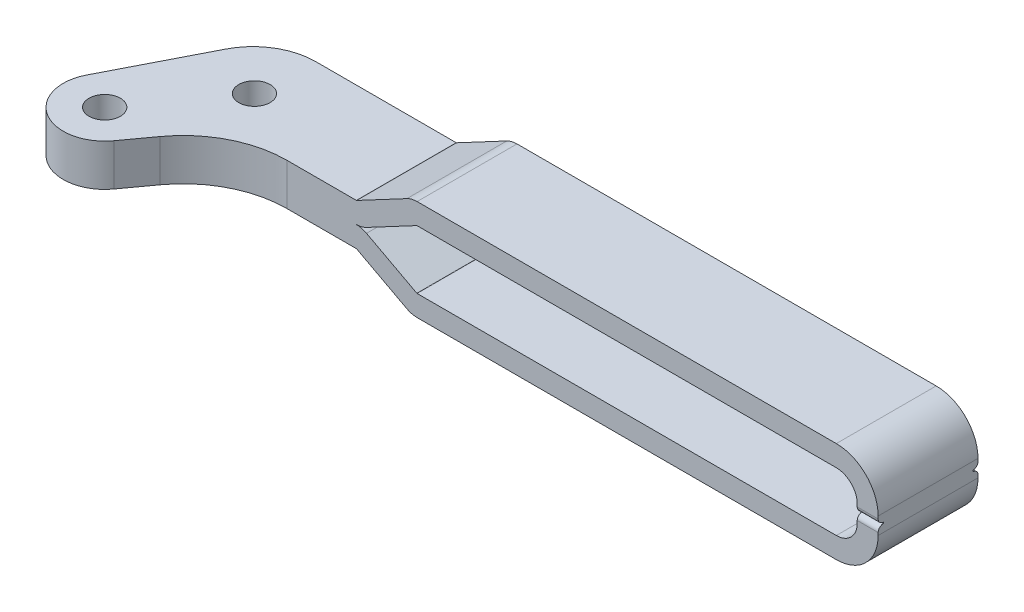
ISO-10303-21;
HEADER;
FILE_DESCRIPTION(('STEP AP214'),'2;1');
FILE_NAME('part.step','',(''),(''),'','','');
FILE_SCHEMA(('AUTOMOTIVE_DESIGN { 1 0 10303 214 1 1 1 1 }'));
ENDSEC;
DATA;
#1=APPLICATION_CONTEXT('core data for automotive mechanical design processes');
#2=APPLICATION_PROTOCOL_DEFINITION('international standard','automotive_design',2000,#1);
#3=PRODUCT_CONTEXT('',#1,'mechanical');
#4=PRODUCT('Part','Part','',(#3));
#5=PRODUCT_RELATED_PRODUCT_CATEGORY('part','',(#4));
#6=PRODUCT_DEFINITION_FORMATION('','',#4);
#7=PRODUCT_DEFINITION_CONTEXT('part definition',#1,'design');
#8=PRODUCT_DEFINITION('design','',#6,#7);
#9=PRODUCT_DEFINITION_SHAPE('','',#8);
#10=(LENGTH_UNIT() NAMED_UNIT(*) SI_UNIT(.MILLI.,.METRE.));
#11=(NAMED_UNIT(*) PLANE_ANGLE_UNIT() SI_UNIT($,.RADIAN.));
#12=(NAMED_UNIT(*) SI_UNIT($,.STERADIAN.) SOLID_ANGLE_UNIT());
#13=UNCERTAINTY_MEASURE_WITH_UNIT(LENGTH_MEASURE(1.E-05),#10,'distance_accuracy_value','');
#14=(GEOMETRIC_REPRESENTATION_CONTEXT(3) GLOBAL_UNCERTAINTY_ASSIGNED_CONTEXT((#13)) GLOBAL_UNIT_ASSIGNED_CONTEXT((#10,
#11,#12)) REPRESENTATION_CONTEXT('',''));
#15=CARTESIAN_POINT('',(0.,0.,0.));
#16=DIRECTION('',(0.,0.,1.));
#17=DIRECTION('',(1.,0.,0.));
#18=AXIS2_PLACEMENT_3D('',#15,#16,#17);
#19=CARTESIAN_POINT('',(26.2035584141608,4.,11.1981815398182));
#20=DIRECTION('',(0.,-1.,0.));
#21=DIRECTION('',(1.,0.,0.));
#22=AXIS2_PLACEMENT_3D('',#19,#20,#21);
#23=CYLINDRICAL_SURFACE('',#22,19.8437500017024);
#24=DIRECTION('',(0.,-1.,0.));
#25=VECTOR('',#24,1.);
#26=CARTESIAN_POINT('',(10.149627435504,4.00000000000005,-0.465682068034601));
#27=LINE('',#26,#25);
#28=CARTESIAN_POINT('',(10.1496274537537,-4.00000000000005,-0.465682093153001));
#29=VERTEX_POINT('',#28);
#30=CARTESIAN_POINT('',(10.1496274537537,4.00000000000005,-0.465682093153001));
#31=VERTEX_POINT('',#30);
#32=EDGE_CURVE('E201',#29,#31,#27,.F.);
#33=ORIENTED_EDGE('',*,*,#32,.F.);
#34=CARTESIAN_POINT('',(26.2035584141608,-4.00000000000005,11.1981815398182));
#35=DIRECTION('',(0.,-1.,0.));
#36=DIRECTION('',(1.,0.,0.));
#37=AXIS2_PLACEMENT_3D('',#34,#35,#36);
#38=CIRCLE('',#37,19.8437500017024);
#39=CARTESIAN_POINT('',(26.2035584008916,-4.00000000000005,-8.64556846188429));
#40=VERTEX_POINT('',#39);
#41=EDGE_CURVE('E306',#29,#40,#38,.T.);
#42=ORIENTED_EDGE('',*,*,#41,.T.);
#43=DIRECTION('',(0.,-1.,0.));
#44=VECTOR('',#43,1.);
#45=CARTESIAN_POINT('',(26.203558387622,4.,-8.64556846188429));
#46=LINE('',#45,#44);
#47=CARTESIAN_POINT('',(26.2035584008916,4.00000000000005,-8.64556846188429));
#48=VERTEX_POINT('',#47);
#49=EDGE_CURVE('E203',#48,#40,#46,.T.);
#50=ORIENTED_EDGE('',*,*,#49,.F.);
#51=CARTESIAN_POINT('',(26.2035584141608,4.00000000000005,11.1981815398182));
#52=DIRECTION('',(0.,-1.,0.));
#53=DIRECTION('',(1.,0.,0.));
#54=AXIS2_PLACEMENT_3D('',#51,#52,#53);
#55=CIRCLE('',#54,19.8437500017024);
#56=EDGE_CURVE('E205',#31,#48,#55,.T.);
#57=ORIENTED_EDGE('',*,*,#56,.F.);
#58=EDGE_LOOP('',(#33,#42,#50,#57));
#59=FACE_BOUND('',#58,.T.);
#60=ADVANCED_FACE('F14',(#59),#23,.F.);
#61=CARTESIAN_POINT('',(10.149627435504,4.00000000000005,-0.465682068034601));
#62=DIRECTION('',(0.809016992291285,0.,0.587785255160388));
#63=DIRECTION('',(-0.587785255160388,0.,0.809016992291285));
#64=AXIS2_PLACEMENT_3D('',#61,#62,#63);
#65=PLANE('',#64);
#66=DIRECTION('',(0.,-1.,0.));
#67=VECTOR('',#66,1.);
#68=CARTESIAN_POINT('',(6.4215723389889,4.,4.6655455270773));
#69=LINE('',#68,#67);
#70=CARTESIAN_POINT('',(6.4215723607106,-4.00000000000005,4.66554549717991));
#71=VERTEX_POINT('',#70);
#72=CARTESIAN_POINT('',(6.4215723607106,4.00000000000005,4.66554549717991));
#73=VERTEX_POINT('',#72);
#74=EDGE_CURVE('E198',#71,#73,#69,.F.);
#75=ORIENTED_EDGE('',*,*,#74,.F.);
#76=DIRECTION('',(-0.587785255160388,0.,0.809016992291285));
#77=VECTOR('',#76,1.);
#78=CARTESIAN_POINT('',(10.149627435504,-4.00000000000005,-0.465682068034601));
#79=LINE('',#78,#77);
#80=EDGE_CURVE('E311',#29,#71,#79,.T.);
#81=ORIENTED_EDGE('',*,*,#80,.F.);
#82=ORIENTED_EDGE('',*,*,#32,.T.);
#83=DIRECTION('',(-0.587785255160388,0.,0.809016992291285));
#84=VECTOR('',#83,1.);
#85=CARTESIAN_POINT('',(10.149627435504,4.00000000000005,-0.465682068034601));
#86=LINE('',#85,#84);
#87=EDGE_CURVE('E200',#31,#73,#86,.T.);
#88=ORIENTED_EDGE('',*,*,#87,.T.);
#89=EDGE_LOOP('',(#75,#81,#82,#88));
#90=FACE_BOUND('',#89,.T.);
#91=ADVANCED_FACE('F296',(#90),#65,.T.);
#92=CARTESIAN_POINT('',(-3.50414142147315E-13,4.,1.04083408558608E-13));
#93=DIRECTION('',(0.,-1.,0.));
#94=DIRECTION('',(1.,0.,0.));
#95=AXIS2_PLACEMENT_3D('',#92,#93,#94);
#96=CYLINDRICAL_SURFACE('',#95,7.93750000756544);
#97=DIRECTION('',(0.,-1.,0.));
#98=VECTOR('',#97,1.);
#99=CARTESIAN_POINT('',(-7.06673854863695,4.00000000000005,-3.61456949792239));
#100=LINE('',#99,#98);
#101=CARTESIAN_POINT('',(-7.0667385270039,-4.00000000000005,-3.6145695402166));
#102=VERTEX_POINT('',#101);
#103=CARTESIAN_POINT('',(-7.0667385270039,4.00000000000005,-3.6145695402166));
#104=VERTEX_POINT('',#103);
#105=EDGE_CURVE('E195',#102,#104,#100,.F.);
#106=ORIENTED_EDGE('',*,*,#105,.F.);
#107=CARTESIAN_POINT('',(-3.50414142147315E-13,-4.,1.04083408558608E-13));
#108=DIRECTION('',(0.,-1.,0.));
#109=DIRECTION('',(1.,0.,0.));
#110=AXIS2_PLACEMENT_3D('',#107,#108,#109);
#111=CIRCLE('',#110,7.93750000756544);
#112=EDGE_CURVE('E292',#71,#102,#111,.T.);
#113=ORIENTED_EDGE('',*,*,#112,.F.);
#114=ORIENTED_EDGE('',*,*,#74,.T.);
#115=CARTESIAN_POINT('',(-3.50414142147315E-13,4.,1.04083408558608E-13));
#116=DIRECTION('',(0.,-1.,0.));
#117=DIRECTION('',(1.,0.,0.));
#118=AXIS2_PLACEMENT_3D('',#115,#116,#117);
#119=CIRCLE('',#118,7.93750000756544);
#120=EDGE_CURVE('E197',#73,#104,#119,.T.);
#121=ORIENTED_EDGE('',*,*,#120,.T.);
#122=EDGE_LOOP('',(#106,#113,#114,#121));
#123=FACE_BOUND('',#122,.T.);
#124=ADVANCED_FACE('F289',(#123),#96,.T.);
#125=CARTESIAN_POINT('',(-7.06673854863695,4.00000000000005,-3.6145694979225));
#126=DIRECTION('',(-0.89029776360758,0.,-0.45537884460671));
#127=DIRECTION('',(0.45537884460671,0.,-0.89029776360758));
#128=AXIS2_PLACEMENT_3D('',#125,#126,#127);
#129=PLANE('',#128);
#130=DIRECTION('',(0.,-1.,0.));
#131=VECTOR('',#130,1.);
#132=CARTESIAN_POINT('',(1.93150828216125,4.,-21.2067767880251));
#133=LINE('',#132,#131);
#134=CARTESIAN_POINT('',(1.93150828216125,-4.,-21.2067767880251));
#135=VERTEX_POINT('',#134);
#136=CARTESIAN_POINT('',(1.93150828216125,4.,-21.2067767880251));
#137=VERTEX_POINT('',#136);
#138=EDGE_CURVE('E192',#135,#137,#133,.F.);
#139=ORIENTED_EDGE('',*,*,#138,.F.);
#140=DIRECTION('',(0.45537884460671,0.,-0.89029776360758));
#141=VECTOR('',#140,1.);
#142=CARTESIAN_POINT('',(-7.06673854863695,-4.00000000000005,-3.6145694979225));
#143=LINE('',#142,#141);
#144=EDGE_CURVE('E285',#102,#135,#143,.T.);
#145=ORIENTED_EDGE('',*,*,#144,.F.);
#146=ORIENTED_EDGE('',*,*,#105,.T.);
#147=DIRECTION('',(0.45537884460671,0.,-0.89029776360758));
#148=VECTOR('',#147,1.);
#149=CARTESIAN_POINT('',(-7.06673854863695,4.00000000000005,-3.6145694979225));
#150=LINE('',#149,#148);
#151=EDGE_CURVE('E194',#104,#137,#150,.T.);
#152=ORIENTED_EDGE('',*,*,#151,.T.);
#153=EDGE_LOOP('',(#139,#145,#146,#152));
#154=FACE_BOUND('',#153,.T.);
#155=ADVANCED_FACE('F279',(#154),#129,.T.);
#156=CARTESIAN_POINT('',(12.6150814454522,4.,-15.7422306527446));
#157=DIRECTION('',(0.,-1.,0.));
#158=DIRECTION('',(1.,0.,0.));
#159=AXIS2_PLACEMENT_3D('',#156,#157,#158);
#160=CYLINDRICAL_SURFACE('',#159,12.);
#161=DIRECTION('',(0.,-1.,0.));
#162=VECTOR('',#161,1.);
#163=CARTESIAN_POINT('',(12.6150814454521,4.,-27.7422306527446));
#164=LINE('',#163,#162);
#165=CARTESIAN_POINT('',(12.6150814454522,-4.,-27.7422306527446));
#166=VERTEX_POINT('',#165);
#167=CARTESIAN_POINT('',(12.6150814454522,4.,-27.7422306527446));
#168=VERTEX_POINT('',#167);
#169=EDGE_CURVE('E188',#166,#168,#164,.F.);
#170=ORIENTED_EDGE('',*,*,#169,.F.);
#171=CARTESIAN_POINT('',(12.6150814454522,-3.99999999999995,-15.7422306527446));
#172=DIRECTION('',(0.,-1.,0.));
#173=DIRECTION('',(1.,0.,0.));
#174=AXIS2_PLACEMENT_3D('',#171,#172,#173);
#175=CIRCLE('',#174,12.);
#176=EDGE_CURVE('E577',#135,#166,#175,.T.);
#177=ORIENTED_EDGE('',*,*,#176,.F.);
#178=ORIENTED_EDGE('',*,*,#138,.T.);
#179=CARTESIAN_POINT('',(12.6150814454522,3.99999999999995,-15.7422306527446));
#180=DIRECTION('',(0.,-1.,0.));
#181=DIRECTION('',(1.,0.,0.));
#182=AXIS2_PLACEMENT_3D('',#179,#180,#181);
#183=CIRCLE('',#182,12.);
#184=EDGE_CURVE('E191',#137,#168,#183,.T.);
#185=ORIENTED_EDGE('',*,*,#184,.T.);
#186=EDGE_LOOP('',(#170,#177,#178,#185));
#187=FACE_BOUND('',#186,.T.);
#188=ADVANCED_FACE('F273',(#187),#160,.T.);
#189=CARTESIAN_POINT('',(11.2585270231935,9.61268213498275,-27.7422306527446));
#190=DIRECTION('',(0.,0.,-1.));
#191=DIRECTION('',(1.,0.,0.));
#192=AXIS2_PLACEMENT_3D('',#189,#190,#191);
#193=PLANE('',#192);
#194=CARTESIAN_POINT('',(39.4746558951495,4.14999999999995,-27.7422306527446));
#195=DIRECTION('',(0.,0.,1.));
#196=DIRECTION('',(0.,-1.,0.));
#197=AXIS2_PLACEMENT_3D('',#194,#195,#196);
#198=CIRCLE('',#197,4.15);
#199=CARTESIAN_POINT('',(39.4746558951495,0.,-27.7422306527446));
#200=VERTEX_POINT('',#199);
#201=CARTESIAN_POINT('',(41.4229628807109,0.485767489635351,-27.7422306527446));
#202=VERTEX_POINT('',#201);
#203=EDGE_CURVE('E149',#200,#202,#198,.T.);
#204=ORIENTED_EDGE('',*,*,#203,.F.);
#205=CARTESIAN_POINT('',(39.4746558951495,-4.14999999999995,-27.7422306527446));
#206=DIRECTION('',(0.,0.,-1.));
#207=DIRECTION('',(0.,1.,0.));
#208=AXIS2_PLACEMENT_3D('',#205,#206,#207);
#209=CIRCLE('',#208,4.15);
#210=CARTESIAN_POINT('',(41.4229628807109,-0.485767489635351,-27.7422306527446));
#211=VERTEX_POINT('',#210);
#212=EDGE_CURVE('E550',#200,#211,#209,.T.);
#213=ORIENTED_EDGE('',*,*,#212,.T.);
#214=DIRECTION('',(0.882947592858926,-0.469471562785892,0.));
#215=VECTOR('',#214,1.);
#216=CARTESIAN_POINT('',(131.491168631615,-48.3758819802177,-27.7422306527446));
#217=LINE('',#216,#215);
#218=CARTESIAN_POINT('',(51.0322654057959,-5.59512427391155,-27.7422306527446));
#219=VERTEX_POINT('',#218);
#220=EDGE_CURVE('E545',#211,#219,#217,.T.);
#221=ORIENTED_EDGE('',*,*,#220,.T.);
#222=CARTESIAN_POINT('',(51.1026861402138,-5.46268213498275,-27.7422306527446));
#223=DIRECTION('',(0.,0.,-1.));
#224=DIRECTION('',(0.,1.,0.));
#225=AXIS2_PLACEMENT_3D('',#222,#223,#224);
#226=CIRCLE('',#225,0.15);
#227=CARTESIAN_POINT('',(51.1026861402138,-5.61268213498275,-27.7422306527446));
#228=VERTEX_POINT('',#227);
#229=EDGE_CURVE('E573',#228,#219,#226,.T.);
#230=ORIENTED_EDGE('',*,*,#229,.F.);
#231=DIRECTION('',(1.,0.,0.));
#232=VECTOR('',#231,1.);
#233=CARTESIAN_POINT('',(141.177342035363,-5.61268213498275,-27.7422306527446));
#234=LINE('',#233,#232);
#235=CARTESIAN_POINT('',(131.264953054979,-5.61268213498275,-27.7422306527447));
#236=VERTEX_POINT('',#235);
#237=EDGE_CURVE('E522',#228,#236,#234,.T.);
#238=ORIENTED_EDGE('',*,*,#237,.T.);
#239=CARTESIAN_POINT('',(131.264953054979,-1.61268213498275,-27.7422306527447));
#240=DIRECTION('',(0.,0.,1.));
#241=DIRECTION('',(0.,-1.,0.));
#242=AXIS2_PLACEMENT_3D('',#239,#240,#241);
#243=CIRCLE('',#242,4.);
#244=CARTESIAN_POINT('',(135.264953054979,-1.61268213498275,-27.7422306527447));
#245=VERTEX_POINT('',#244);
#246=EDGE_CURVE('E525',#245,#236,#243,.F.);
#247=ORIENTED_EDGE('',*,*,#246,.F.);
#248=DIRECTION('',(0.,1.,0.));
#249=VECTOR('',#248,1.);
#250=CARTESIAN_POINT('',(135.264953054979,-1.1250711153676,-27.7422306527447));
#251=LINE('',#250,#249);
#252=CARTESIAN_POINT('',(135.264953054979,-1.12507111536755,-27.7422306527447));
#253=VERTEX_POINT('',#252);
#254=EDGE_CURVE('E531',#245,#253,#251,.T.);
#255=ORIENTED_EDGE('',*,*,#254,.T.);
#256=DIRECTION('',(1.,0.,0.));
#257=VECTOR('',#256,1.);
#258=CARTESIAN_POINT('',(139.264953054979,-1.1250711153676,-27.7422306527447));
#259=LINE('',#258,#257);
#260=CARTESIAN_POINT('',(139.264953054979,-1.12507111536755,-27.7422306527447));
#261=VERTEX_POINT('',#260);
#262=EDGE_CURVE('E558',#261,#253,#259,.F.);
#263=ORIENTED_EDGE('',*,*,#262,.F.);
#264=DIRECTION('',(0.,-1.,0.));
#265=VECTOR('',#264,1.);
#266=CARTESIAN_POINT('',(139.264953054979,-131.043886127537,-27.7422306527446));
#267=LINE('',#266,#265);
#268=CARTESIAN_POINT('',(139.264953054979,-1.61268213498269,-27.7422306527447));
#269=VERTEX_POINT('',#268);
#270=EDGE_CURVE('E477',#269,#261,#267,.F.);
#271=ORIENTED_EDGE('',*,*,#270,.F.);
#272=CARTESIAN_POINT('',(131.264953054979,-1.61268213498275,-27.7422306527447));
#273=DIRECTION('',(0.,0.,1.));
#274=DIRECTION('',(0.,-1.,0.));
#275=AXIS2_PLACEMENT_3D('',#272,#273,#274);
#276=CIRCLE('',#275,8.);
#277=CARTESIAN_POINT('',(131.264953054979,-9.61268213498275,-27.7422306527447));
#278=VERTEX_POINT('',#277);
#279=EDGE_CURVE('E530',#278,#269,#276,.T.);
#280=ORIENTED_EDGE('',*,*,#279,.F.);
#281=DIRECTION('',(1.,0.,0.));
#282=VECTOR('',#281,1.);
#283=CARTESIAN_POINT('',(11.2585270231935,-9.61268213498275,-27.7422306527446));
#284=LINE('',#283,#282);
#285=CARTESIAN_POINT('',(51.1026861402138,-9.61268213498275,-27.7422306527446));
#286=VERTEX_POINT('',#285);
#287=EDGE_CURVE('E526',#286,#278,#284,.T.);
#288=ORIENTED_EDGE('',*,*,#287,.F.);
#289=CARTESIAN_POINT('',(51.1026861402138,-5.46268213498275,-27.7422306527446));
#290=DIRECTION('',(0.,0.,-1.));
#291=DIRECTION('',(0.,1.,0.));
#292=AXIS2_PLACEMENT_3D('',#289,#290,#291);
#293=CIRCLE('',#292,4.15);
#294=CARTESIAN_POINT('',(49.1543791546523,-9.1269146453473,-27.7422306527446));
#295=VERTEX_POINT('',#294);
#296=EDGE_CURVE('E534',#295,#286,#293,.F.);
#297=ORIENTED_EDGE('',*,*,#296,.F.);
#298=DIRECTION('',(0.882947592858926,-0.469471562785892,0.));
#299=VECTOR('',#298,1.);
#300=CARTESIAN_POINT('',(39.5450766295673,-4.0175578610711,-27.7422306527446));
#301=LINE('',#300,#299);
#302=CARTESIAN_POINT('',(39.5450766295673,-4.0175578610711,-27.7422306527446));
#303=VERTEX_POINT('',#302);
#304=EDGE_CURVE('E540',#303,#295,#301,.T.);
#305=ORIENTED_EDGE('',*,*,#304,.F.);
#306=CARTESIAN_POINT('',(39.4746558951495,-4.14999999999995,-27.7422306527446));
#307=DIRECTION('',(0.,0.,-1.));
#308=DIRECTION('',(0.,1.,0.));
#309=AXIS2_PLACEMENT_3D('',#306,#307,#308);
#310=CIRCLE('',#309,0.149999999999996);
#311=CARTESIAN_POINT('',(39.4746558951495,-4.,-27.7422306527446));
#312=VERTEX_POINT('',#311);
#313=EDGE_CURVE('E315',#312,#303,#310,.T.);
#314=ORIENTED_EDGE('',*,*,#313,.F.);
#315=DIRECTION('',(1.,0.,0.));
#316=VECTOR('',#315,1.);
#317=CARTESIAN_POINT('',(12.6150814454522,-4.,-27.7422306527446));
#318=LINE('',#317,#316);
#319=EDGE_CURVE('E269',#166,#312,#318,.T.);
#320=ORIENTED_EDGE('',*,*,#319,.F.);
#321=ORIENTED_EDGE('',*,*,#169,.T.);
#322=DIRECTION('',(1.,0.,0.));
#323=VECTOR('',#322,1.);
#324=CARTESIAN_POINT('',(12.6150814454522,4.,-27.7422306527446));
#325=LINE('',#324,#323);
#326=CARTESIAN_POINT('',(39.4746558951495,4.,-27.7422306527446));
#327=VERTEX_POINT('',#326);
#328=EDGE_CURVE('E190',#168,#327,#325,.T.);
#329=ORIENTED_EDGE('',*,*,#328,.T.);
#330=CARTESIAN_POINT('',(39.4746558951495,4.14999999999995,-27.7422306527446));
#331=DIRECTION('',(0.,0.,1.));
#332=DIRECTION('',(0.,-1.,0.));
#333=AXIS2_PLACEMENT_3D('',#330,#331,#332);
#334=CIRCLE('',#333,0.149999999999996);
#335=CARTESIAN_POINT('',(39.5450766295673,4.0175578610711,-27.7422306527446));
#336=VERTEX_POINT('',#335);
#337=EDGE_CURVE('E208',#327,#336,#334,.T.);
#338=ORIENTED_EDGE('',*,*,#337,.T.);
#339=DIRECTION('',(0.882947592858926,0.469471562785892,0.));
#340=VECTOR('',#339,1.);
#341=CARTESIAN_POINT('',(39.5450766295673,4.0175578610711,-27.7422306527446));
#342=LINE('',#341,#340);
#343=CARTESIAN_POINT('',(49.1543791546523,9.1269146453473,-27.7422306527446));
#344=VERTEX_POINT('',#343);
#345=EDGE_CURVE('E139',#336,#344,#342,.T.);
#346=ORIENTED_EDGE('',*,*,#345,.T.);
#347=CARTESIAN_POINT('',(51.1026861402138,5.46268213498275,-27.7422306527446));
#348=DIRECTION('',(0.,0.,1.));
#349=DIRECTION('',(0.,-1.,0.));
#350=AXIS2_PLACEMENT_3D('',#347,#348,#349);
#351=CIRCLE('',#350,4.15);
#352=CARTESIAN_POINT('',(51.1026861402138,9.61268213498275,-27.7422306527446));
#353=VERTEX_POINT('',#352);
#354=EDGE_CURVE('E235',#344,#353,#351,.F.);
#355=ORIENTED_EDGE('',*,*,#354,.T.);
#356=DIRECTION('',(1.,0.,0.));
#357=VECTOR('',#356,1.);
#358=CARTESIAN_POINT('',(11.2585270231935,9.61268213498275,-27.7422306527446));
#359=LINE('',#358,#357);
#360=CARTESIAN_POINT('',(131.264953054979,9.61268213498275,-27.7422306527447));
#361=VERTEX_POINT('',#360);
#362=EDGE_CURVE('E186',#353,#361,#359,.T.);
#363=ORIENTED_EDGE('',*,*,#362,.T.);
#364=CARTESIAN_POINT('',(131.264953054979,1.61268213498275,-27.7422306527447));
#365=DIRECTION('',(0.,0.,-1.));
#366=DIRECTION('',(0.,1.,0.));
#367=AXIS2_PLACEMENT_3D('',#364,#365,#366);
#368=CIRCLE('',#367,8.);
#369=CARTESIAN_POINT('',(139.264953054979,1.61268213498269,-27.7422306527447));
#370=VERTEX_POINT('',#369);
#371=EDGE_CURVE('E231',#361,#370,#368,.T.);
#372=ORIENTED_EDGE('',*,*,#371,.T.);
#373=DIRECTION('',(0.,1.,0.));
#374=VECTOR('',#373,1.);
#375=CARTESIAN_POINT('',(139.264953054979,131.043886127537,-27.7422306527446));
#376=LINE('',#375,#374);
#377=CARTESIAN_POINT('',(139.264953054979,1.12507111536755,-27.7422306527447));
#378=VERTEX_POINT('',#377);
#379=EDGE_CURVE('E167',#370,#378,#376,.F.);
#380=ORIENTED_EDGE('',*,*,#379,.T.);
#381=DIRECTION('',(1.,0.,0.));
#382=VECTOR('',#381,1.);
#383=CARTESIAN_POINT('',(139.264953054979,1.1250711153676,-27.7422306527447));
#384=LINE('',#383,#382);
#385=CARTESIAN_POINT('',(135.264953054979,1.12507111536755,-27.7422306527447));
#386=VERTEX_POINT('',#385);
#387=EDGE_CURVE('E170',#378,#386,#384,.F.);
#388=ORIENTED_EDGE('',*,*,#387,.T.);
#389=DIRECTION('',(0.,-1.,0.));
#390=VECTOR('',#389,1.);
#391=CARTESIAN_POINT('',(135.264953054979,1.1250711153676,-27.7422306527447));
#392=LINE('',#391,#390);
#393=CARTESIAN_POINT('',(135.264953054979,1.61268213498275,-27.7422306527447));
#394=VERTEX_POINT('',#393);
#395=EDGE_CURVE('E238',#394,#386,#392,.T.);
#396=ORIENTED_EDGE('',*,*,#395,.F.);
#397=CARTESIAN_POINT('',(131.264953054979,1.61268213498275,-27.7422306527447));
#398=DIRECTION('',(0.,0.,-1.));
#399=DIRECTION('',(0.,1.,0.));
#400=AXIS2_PLACEMENT_3D('',#397,#398,#399);
#401=CIRCLE('',#400,4.);
#402=CARTESIAN_POINT('',(131.264953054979,5.61268213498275,-27.7422306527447));
#403=VERTEX_POINT('',#402);
#404=EDGE_CURVE('E220',#394,#403,#401,.F.);
#405=ORIENTED_EDGE('',*,*,#404,.T.);
#406=DIRECTION('',(1.,0.,0.));
#407=VECTOR('',#406,1.);
#408=CARTESIAN_POINT('',(141.177342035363,5.61268213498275,-27.7422306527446));
#409=LINE('',#408,#407);
#410=CARTESIAN_POINT('',(51.1026861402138,5.61268213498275,-27.7422306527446));
#411=VERTEX_POINT('',#410);
#412=EDGE_CURVE('E337',#411,#403,#409,.T.);
#413=ORIENTED_EDGE('',*,*,#412,.F.);
#414=CARTESIAN_POINT('',(51.1026861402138,5.46268213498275,-27.7422306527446));
#415=DIRECTION('',(0.,0.,1.));
#416=DIRECTION('',(0.,-1.,0.));
#417=AXIS2_PLACEMENT_3D('',#414,#415,#416);
#418=CIRCLE('',#417,0.15);
#419=CARTESIAN_POINT('',(51.0322654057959,5.59512427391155,-27.7422306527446));
#420=VERTEX_POINT('',#419);
#421=EDGE_CURVE('E239',#411,#420,#418,.T.);
#422=ORIENTED_EDGE('',*,*,#421,.T.);
#423=DIRECTION('',(0.882947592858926,0.469471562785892,0.));
#424=VECTOR('',#423,1.);
#425=CARTESIAN_POINT('',(131.491168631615,48.3758819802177,-27.7422306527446));
#426=LINE('',#425,#424);
#427=EDGE_CURVE('E180',#202,#420,#426,.T.);
#428=ORIENTED_EDGE('',*,*,#427,.F.);
#429=EDGE_LOOP('',(#204,#213,#221,#230,#238,#247,#255,#263,#271,#280,#288,#297,#305,#314,#320,
#321,#329,#338,#346,#355,#363,#372,#380,#388,#396,#405,#413,#422,#428));
#430=FACE_BOUND('',#429,.T.);
#431=ADVANCED_FACE('F263',(#430),#193,.T.);
#432=CARTESIAN_POINT('',(24.8470039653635,9.61268213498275,-8.64556846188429));
#433=DIRECTION('',(0.,0.,1.));
#434=DIRECTION('',(0.,-1.,0.));
#435=AXIS2_PLACEMENT_3D('',#432,#433,#434);
#436=PLANE('',#435);
#437=ORIENTED_EDGE('',*,*,#49,.T.);
#438=DIRECTION('',(1.,0.,0.));
#439=VECTOR('',#438,1.);
#440=CARTESIAN_POINT('',(26.203558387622,-4.,-8.64556846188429));
#441=LINE('',#440,#439);
#442=CARTESIAN_POINT('',(39.4746558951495,-4.,-8.64556846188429));
#443=VERTEX_POINT('',#442);
#444=EDGE_CURVE('E312',#443,#40,#441,.F.);
#445=ORIENTED_EDGE('',*,*,#444,.F.);
#446=CARTESIAN_POINT('',(39.4746558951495,-4.14999999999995,-8.64556846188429));
#447=DIRECTION('',(0.,0.,-1.));
#448=DIRECTION('',(0.,1.,0.));
#449=AXIS2_PLACEMENT_3D('',#446,#447,#448);
#450=CIRCLE('',#449,0.149999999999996);
#451=CARTESIAN_POINT('',(39.5450766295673,-4.0175578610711,-8.64556846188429));
#452=VERTEX_POINT('',#451);
#453=EDGE_CURVE('E325',#452,#443,#450,.F.);
#454=ORIENTED_EDGE('',*,*,#453,.F.);
#455=DIRECTION('',(-0.882947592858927,0.469471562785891,0.));
#456=VECTOR('',#455,1.);
#457=CARTESIAN_POINT('',(49.1543791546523,-9.12691464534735,-8.64556846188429));
#458=LINE('',#457,#456);
#459=CARTESIAN_POINT('',(49.1543791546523,-9.1269146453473,-8.64556846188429));
#460=VERTEX_POINT('',#459);
#461=EDGE_CURVE('E547',#460,#452,#458,.T.);
#462=ORIENTED_EDGE('',*,*,#461,.F.);
#463=CARTESIAN_POINT('',(51.1026861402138,-5.46268213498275,-8.64556846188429));
#464=DIRECTION('',(0.,0.,-1.));
#465=DIRECTION('',(0.,1.,0.));
#466=AXIS2_PLACEMENT_3D('',#463,#464,#465);
#467=CIRCLE('',#466,4.15);
#468=CARTESIAN_POINT('',(51.1026861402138,-9.61268213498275,-8.64556846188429));
#469=VERTEX_POINT('',#468);
#470=EDGE_CURVE('E566',#469,#460,#467,.T.);
#471=ORIENTED_EDGE('',*,*,#470,.F.);
#472=DIRECTION('',(1.,0.,0.));
#473=VECTOR('',#472,1.);
#474=CARTESIAN_POINT('',(24.8470039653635,-9.61268213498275,-8.64556846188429));
#475=LINE('',#474,#473);
#476=CARTESIAN_POINT('',(131.264953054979,-9.61268213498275,-8.64556846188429));
#477=VERTEX_POINT('',#476);
#478=EDGE_CURVE('E505',#477,#469,#475,.F.);
#479=ORIENTED_EDGE('',*,*,#478,.F.);
#480=CARTESIAN_POINT('',(131.264953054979,-1.61268213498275,-8.64556846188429));
#481=DIRECTION('',(0.,0.,1.));
#482=DIRECTION('',(0.,-1.,0.));
#483=AXIS2_PLACEMENT_3D('',#480,#481,#482);
#484=CIRCLE('',#483,8.);
#485=CARTESIAN_POINT('',(139.264953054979,-1.61268213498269,-8.64556846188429));
#486=VERTEX_POINT('',#485);
#487=EDGE_CURVE('E518',#486,#477,#484,.F.);
#488=ORIENTED_EDGE('',*,*,#487,.F.);
#489=DIRECTION('',(0.,1.,0.));
#490=VECTOR('',#489,1.);
#491=CARTESIAN_POINT('',(139.264953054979,-117.455409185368,-8.64556846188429));
#492=LINE('',#491,#490);
#493=CARTESIAN_POINT('',(139.264953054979,-1.12507111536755,-8.64556846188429));
#494=VERTEX_POINT('',#493);
#495=EDGE_CURVE('E552',#494,#486,#492,.F.);
#496=ORIENTED_EDGE('',*,*,#495,.F.);
#497=DIRECTION('',(1.,0.,0.));
#498=VECTOR('',#497,1.);
#499=CARTESIAN_POINT('',(139.264953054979,-1.1250711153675,-8.64556846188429));
#500=LINE('',#499,#498);
#501=CARTESIAN_POINT('',(135.264953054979,-1.12507111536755,-8.64556846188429));
#502=VERTEX_POINT('',#501);
#503=EDGE_CURVE('E555',#502,#494,#500,.T.);
#504=ORIENTED_EDGE('',*,*,#503,.F.);
#505=DIRECTION('',(0.,1.,0.));
#506=VECTOR('',#505,1.);
#507=CARTESIAN_POINT('',(135.264953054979,-1.1250711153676,-8.64556846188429));
#508=LINE('',#507,#506);
#509=CARTESIAN_POINT('',(135.264953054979,-1.61268213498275,-8.64556846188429));
#510=VERTEX_POINT('',#509);
#511=EDGE_CURVE('E484',#502,#510,#508,.F.);
#512=ORIENTED_EDGE('',*,*,#511,.T.);
#513=CARTESIAN_POINT('',(131.264953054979,-1.61268213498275,-8.64556846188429));
#514=DIRECTION('',(0.,0.,1.));
#515=DIRECTION('',(0.,-1.,0.));
#516=AXIS2_PLACEMENT_3D('',#513,#514,#515);
#517=CIRCLE('',#516,4.);
#518=CARTESIAN_POINT('',(131.264953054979,-5.61268213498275,-8.64556846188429));
#519=VERTEX_POINT('',#518);
#520=EDGE_CURVE('E509',#519,#510,#517,.T.);
#521=ORIENTED_EDGE('',*,*,#520,.F.);
#522=DIRECTION('',(1.,0.,0.));
#523=VECTOR('',#522,1.);
#524=CARTESIAN_POINT('',(141.177342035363,-5.61268213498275,-8.64556846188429));
#525=LINE('',#524,#523);
#526=CARTESIAN_POINT('',(51.1026861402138,-5.61268213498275,-8.64556846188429));
#527=VERTEX_POINT('',#526);
#528=EDGE_CURVE('E511',#519,#527,#525,.F.);
#529=ORIENTED_EDGE('',*,*,#528,.T.);
#530=CARTESIAN_POINT('',(51.1026861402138,-5.46268213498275,-8.64556846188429));
#531=DIRECTION('',(0.,0.,-1.));
#532=DIRECTION('',(0.,1.,0.));
#533=AXIS2_PLACEMENT_3D('',#530,#531,#532);
#534=CIRCLE('',#533,0.15);
#535=CARTESIAN_POINT('',(51.032265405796,-5.59512427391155,-8.64556846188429));
#536=VERTEX_POINT('',#535);
#537=EDGE_CURVE('E520',#536,#527,#534,.F.);
#538=ORIENTED_EDGE('',*,*,#537,.F.);
#539=DIRECTION('',(0.882947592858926,-0.469471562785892,0.));
#540=VECTOR('',#539,1.);
#541=CARTESIAN_POINT('',(131.491168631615,-48.3758819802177,-8.64556846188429));
#542=LINE('',#541,#540);
#543=CARTESIAN_POINT('',(41.4229628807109,-0.485767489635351,-8.64556846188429));
#544=VERTEX_POINT('',#543);
#545=EDGE_CURVE('E542',#536,#544,#542,.F.);
#546=ORIENTED_EDGE('',*,*,#545,.T.);
#547=CARTESIAN_POINT('',(39.4746558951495,-4.14999999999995,-8.64556846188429));
#548=DIRECTION('',(0.,0.,-1.));
#549=DIRECTION('',(0.,1.,0.));
#550=AXIS2_PLACEMENT_3D('',#547,#548,#549);
#551=CIRCLE('',#550,4.15);
#552=CARTESIAN_POINT('',(39.4746558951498,0.,-8.64556846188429));
#553=VERTEX_POINT('',#552);
#554=EDGE_CURVE('E574',#544,#553,#551,.F.);
#555=ORIENTED_EDGE('',*,*,#554,.T.);
#556=CARTESIAN_POINT('',(39.4746558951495,4.14999999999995,-8.64556846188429));
#557=DIRECTION('',(0.,0.,1.));
#558=DIRECTION('',(0.,-1.,0.));
#559=AXIS2_PLACEMENT_3D('',#556,#557,#558);
#560=CIRCLE('',#559,4.15);
#561=CARTESIAN_POINT('',(41.4229628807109,0.485767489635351,-8.64556846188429));
#562=VERTEX_POINT('',#561);
#563=EDGE_CURVE('E152',#562,#553,#560,.F.);
#564=ORIENTED_EDGE('',*,*,#563,.F.);
#565=DIRECTION('',(0.882947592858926,0.469471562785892,0.));
#566=VECTOR('',#565,1.);
#567=CARTESIAN_POINT('',(131.491168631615,48.3758819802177,-8.64556846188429));
#568=LINE('',#567,#566);
#569=CARTESIAN_POINT('',(51.032265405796,5.59512427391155,-8.64556846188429));
#570=VERTEX_POINT('',#569);
#571=EDGE_CURVE('E182',#570,#562,#568,.F.);
#572=ORIENTED_EDGE('',*,*,#571,.F.);
#573=CARTESIAN_POINT('',(51.1026861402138,5.46268213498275,-8.64556846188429));
#574=DIRECTION('',(0.,0.,1.));
#575=DIRECTION('',(0.,-1.,0.));
#576=AXIS2_PLACEMENT_3D('',#573,#574,#575);
#577=CIRCLE('',#576,0.15);
#578=CARTESIAN_POINT('',(51.1026861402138,5.61268213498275,-8.64556846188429));
#579=VERTEX_POINT('',#578);
#580=EDGE_CURVE('E33',#570,#579,#577,.F.);
#581=ORIENTED_EDGE('',*,*,#580,.T.);
#582=DIRECTION('',(1.,0.,0.));
#583=VECTOR('',#582,1.);
#584=CARTESIAN_POINT('',(141.177342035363,5.61268213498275,-8.64556846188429));
#585=LINE('',#584,#583);
#586=CARTESIAN_POINT('',(131.264953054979,5.61268213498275,-8.64556846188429));
#587=VERTEX_POINT('',#586);
#588=EDGE_CURVE('E24',#587,#579,#585,.F.);
#589=ORIENTED_EDGE('',*,*,#588,.F.);
#590=CARTESIAN_POINT('',(131.264953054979,1.61268213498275,-8.64556846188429));
#591=DIRECTION('',(0.,0.,-1.));
#592=DIRECTION('',(0.,1.,0.));
#593=AXIS2_PLACEMENT_3D('',#590,#591,#592);
#594=CIRCLE('',#593,4.);
#595=CARTESIAN_POINT('',(135.264953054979,1.61268213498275,-8.64556846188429));
#596=VERTEX_POINT('',#595);
#597=EDGE_CURVE('E216',#587,#596,#594,.T.);
#598=ORIENTED_EDGE('',*,*,#597,.T.);
#599=DIRECTION('',(0.,-1.,0.));
#600=VECTOR('',#599,1.);
#601=CARTESIAN_POINT('',(135.264953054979,1.1250711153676,-8.64556846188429));
#602=LINE('',#601,#600);
#603=CARTESIAN_POINT('',(135.264953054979,1.12507111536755,-8.64556846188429));
#604=VERTEX_POINT('',#603);
#605=EDGE_CURVE('E234',#604,#596,#602,.F.);
#606=ORIENTED_EDGE('',*,*,#605,.F.);
#607=DIRECTION('',(1.,0.,0.));
#608=VECTOR('',#607,1.);
#609=CARTESIAN_POINT('',(139.264953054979,1.1250711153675,-8.64556846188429));
#610=LINE('',#609,#608);
#611=CARTESIAN_POINT('',(139.264953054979,1.12507111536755,-8.64556846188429));
#612=VERTEX_POINT('',#611);
#613=EDGE_CURVE('E166',#604,#612,#610,.T.);
#614=ORIENTED_EDGE('',*,*,#613,.T.);
#615=DIRECTION('',(0.,-1.,0.));
#616=VECTOR('',#615,1.);
#617=CARTESIAN_POINT('',(139.264953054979,117.455409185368,-8.64556846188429));
#618=LINE('',#617,#616);
#619=CARTESIAN_POINT('',(139.264953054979,1.61268213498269,-8.64556846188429));
#620=VERTEX_POINT('',#619);
#621=EDGE_CURVE('E163',#612,#620,#618,.F.);
#622=ORIENTED_EDGE('',*,*,#621,.T.);
#623=CARTESIAN_POINT('',(131.264953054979,1.61268213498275,-8.64556846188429));
#624=DIRECTION('',(0.,0.,-1.));
#625=DIRECTION('',(0.,1.,0.));
#626=AXIS2_PLACEMENT_3D('',#623,#624,#625);
#627=CIRCLE('',#626,8.);
#628=CARTESIAN_POINT('',(131.264953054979,9.61268213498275,-8.64556846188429));
#629=VERTEX_POINT('',#628);
#630=EDGE_CURVE('E227',#620,#629,#627,.F.);
#631=ORIENTED_EDGE('',*,*,#630,.T.);
#632=DIRECTION('',(1.,0.,0.));
#633=VECTOR('',#632,1.);
#634=CARTESIAN_POINT('',(24.8470039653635,9.61268213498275,-8.64556846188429));
#635=LINE('',#634,#633);
#636=CARTESIAN_POINT('',(51.1026861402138,9.61268213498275,-8.64556846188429));
#637=VERTEX_POINT('',#636);
#638=EDGE_CURVE('E219',#629,#637,#635,.F.);
#639=ORIENTED_EDGE('',*,*,#638,.T.);
#640=CARTESIAN_POINT('',(51.1026861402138,5.46268213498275,-8.64556846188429));
#641=DIRECTION('',(0.,0.,1.));
#642=DIRECTION('',(0.,-1.,0.));
#643=AXIS2_PLACEMENT_3D('',#640,#641,#642);
#644=CIRCLE('',#643,4.15);
#645=CARTESIAN_POINT('',(49.1543791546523,9.1269146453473,-8.64556846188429));
#646=VERTEX_POINT('',#645);
#647=EDGE_CURVE('E148',#637,#646,#644,.T.);
#648=ORIENTED_EDGE('',*,*,#647,.T.);
#649=DIRECTION('',(-0.882947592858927,-0.469471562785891,0.));
#650=VECTOR('',#649,1.);
#651=CARTESIAN_POINT('',(49.1543791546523,9.12691464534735,-8.64556846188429));
#652=LINE('',#651,#650);
#653=CARTESIAN_POINT('',(39.5450766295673,4.0175578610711,-8.64556846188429));
#654=VERTEX_POINT('',#653);
#655=EDGE_CURVE('E136',#646,#654,#652,.T.);
#656=ORIENTED_EDGE('',*,*,#655,.T.);
#657=CARTESIAN_POINT('',(39.4746558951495,4.14999999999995,-8.64556846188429));
#658=DIRECTION('',(0.,0.,1.));
#659=DIRECTION('',(0.,-1.,0.));
#660=AXIS2_PLACEMENT_3D('',#657,#658,#659);
#661=CIRCLE('',#660,0.149999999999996);
#662=CARTESIAN_POINT('',(39.4746558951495,4.,-8.64556846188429));
#663=VERTEX_POINT('',#662);
#664=EDGE_CURVE('E18',#654,#663,#661,.F.);
#665=ORIENTED_EDGE('',*,*,#664,.T.);
#666=DIRECTION('',(1.,0.,0.));
#667=VECTOR('',#666,1.);
#668=CARTESIAN_POINT('',(26.203558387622,4.,-8.64556846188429));
#669=LINE('',#668,#667);
#670=EDGE_CURVE('E206',#663,#48,#669,.F.);
#671=ORIENTED_EDGE('',*,*,#670,.T.);
#672=EDGE_LOOP('',(#437,#445,#454,#462,#471,#479,#488,#496,#504,#512,#521,#529,#538,#546,#555,
#564,#572,#581,#589,#598,#606,#614,#622,#631,#639,#648,#656,#665,#671));
#673=FACE_BOUND('',#672,.T.);
#674=ADVANCED_FACE('F145',(#673),#436,.T.);
#675=CARTESIAN_POINT('',(142.533896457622,4.,-9.6455684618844));
#676=DIRECTION('',(0.,-1.,0.));
#677=DIRECTION('',(1.,0.,0.));
#678=AXIS2_PLACEMENT_3D('',#675,#676,#677);
#679=PLANE('',#678);
#680=DIRECTION('',(0.,0.,1.));
#681=VECTOR('',#680,1.);
#682=CARTESIAN_POINT('',(39.4746558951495,4.,-9.6455684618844));
#683=LINE('',#682,#681);
#684=EDGE_CURVE('E128',#663,#327,#683,.F.);
#685=ORIENTED_EDGE('',*,*,#684,.T.);
#686=ORIENTED_EDGE('',*,*,#328,.F.);
#687=ORIENTED_EDGE('',*,*,#184,.F.);
#688=ORIENTED_EDGE('',*,*,#151,.F.);
#689=ORIENTED_EDGE('',*,*,#120,.F.);
#690=ORIENTED_EDGE('',*,*,#87,.F.);
#691=ORIENTED_EDGE('',*,*,#56,.T.);
#692=ORIENTED_EDGE('',*,*,#670,.F.);
#693=EDGE_LOOP('',(#685,#686,#687,#688,#689,#690,#691,#692));
#694=FACE_BOUND('',#693,.T.);
#695=CARTESIAN_POINT('',(0.,4.,0.));
#696=DIRECTION('',(0.,1.,0.));
#697=DIRECTION('',(0.,0.,1.));
#698=AXIS2_PLACEMENT_3D('',#695,#696,#697);
#699=CIRCLE('',#698,3.);
#700=CARTESIAN_POINT('',(0.,4.,3.));
#701=VERTEX_POINT('',#700);
#702=EDGE_CURVE('E498',#701,#701,#699,.T.);
#703=ORIENTED_EDGE('',*,*,#702,.F.);
#704=EDGE_LOOP('',(#703));
#705=FACE_BOUND('',#704,.T.);
#706=CARTESIAN_POINT('',(12.0483044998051,4.,-16.5830684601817));
#707=DIRECTION('',(0.,1.,0.));
#708=DIRECTION('',(0.,0.,1.));
#709=AXIS2_PLACEMENT_3D('',#706,#707,#708);
#710=CIRCLE('',#709,3.);
#711=CARTESIAN_POINT('',(12.0483044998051,4.,-13.5830684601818));
#712=VERTEX_POINT('',#711);
#713=EDGE_CURVE('E915',#712,#712,#710,.T.);
#714=ORIENTED_EDGE('',*,*,#713,.F.);
#715=EDGE_LOOP('',(#714));
#716=FACE_BOUND('',#715,.T.);
#717=ADVANCED_FACE('F16',(#694,#705,#716),#679,.F.);
#718=CARTESIAN_POINT('',(39.4746558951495,4.14999999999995,-37.733256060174));
#719=DIRECTION('',(0.,0.,1.));
#720=DIRECTION('',(0.,-1.,0.));
#721=AXIS2_PLACEMENT_3D('',#718,#719,#720);
#722=CYLINDRICAL_SURFACE('',#721,0.149999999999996);
#723=ORIENTED_EDGE('',*,*,#684,.F.);
#724=ORIENTED_EDGE('',*,*,#664,.F.);
#725=DIRECTION('',(0.,0.,1.));
#726=VECTOR('',#725,1.);
#727=CARTESIAN_POINT('',(39.5450766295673,4.0175578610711,-9.6455684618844));
#728=LINE('',#727,#726);
#729=EDGE_CURVE('E126',#654,#336,#728,.F.);
#730=ORIENTED_EDGE('',*,*,#729,.T.);
#731=ORIENTED_EDGE('',*,*,#337,.F.);
#732=EDGE_LOOP('',(#723,#724,#730,#731));
#733=FACE_BOUND('',#732,.T.);
#734=ADVANCED_FACE('F124',(#733),#722,.F.);
#735=CARTESIAN_POINT('',(139.264953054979,1.1250711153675,-26.7422306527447));
#736=DIRECTION('',(-1.,0.,0.));
#737=DIRECTION('',(0.,-1.,0.));
#738=AXIS2_PLACEMENT_3D('',#735,#736,#737);
#739=CYLINDRICAL_SURFACE('',#738,1.);
#740=CARTESIAN_POINT('',(139.264953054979,1.1250711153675,-26.7422306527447));
#741=DIRECTION('',(-1.,0.,0.));
#742=DIRECTION('',(0.,-1.,0.));
#743=AXIS2_PLACEMENT_3D('',#740,#741,#742);
#744=CIRCLE('',#743,1.);
#745=CARTESIAN_POINT('',(139.264953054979,0.125071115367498,-26.7422306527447));
#746=VERTEX_POINT('',#745);
#747=EDGE_CURVE('E245',#378,#746,#744,.T.);
#748=ORIENTED_EDGE('',*,*,#747,.T.);
#749=DIRECTION('',(1.,0.,0.));
#750=VECTOR('',#749,1.);
#751=CARTESIAN_POINT('',(139.264953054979,0.125071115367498,-26.7422306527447));
#752=LINE('',#751,#750);
#753=CARTESIAN_POINT('',(135.264953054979,0.125071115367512,-26.7422306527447));
#754=VERTEX_POINT('',#753);
#755=EDGE_CURVE('E140',#754,#746,#752,.T.);
#756=ORIENTED_EDGE('',*,*,#755,.F.);
#757=CARTESIAN_POINT('',(135.264953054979,1.1250711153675,-26.7422306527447));
#758=DIRECTION('',(-1.,0.,0.));
#759=DIRECTION('',(0.,-1.,0.));
#760=AXIS2_PLACEMENT_3D('',#757,#758,#759);
#761=CIRCLE('',#760,1.);
#762=EDGE_CURVE('E211',#754,#386,#761,.F.);
#763=ORIENTED_EDGE('',*,*,#762,.T.);
#764=ORIENTED_EDGE('',*,*,#387,.F.);
#765=EDGE_LOOP('',(#748,#756,#763,#764));
#766=FACE_BOUND('',#765,.T.);
#767=ADVANCED_FACE('F695',(#766),#739,.T.);
#768=CARTESIAN_POINT('',(139.264953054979,1.1250711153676,-9.6455684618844));
#769=DIRECTION('',(-1.,0.,0.));
#770=DIRECTION('',(0.,-1.,0.));
#771=AXIS2_PLACEMENT_3D('',#768,#769,#770);
#772=CYLINDRICAL_SURFACE('',#771,1.00000000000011);
#773=CARTESIAN_POINT('',(139.264953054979,1.1250711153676,-9.6455684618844));
#774=DIRECTION('',(-1.,0.,0.));
#775=DIRECTION('',(0.,-1.,0.));
#776=AXIS2_PLACEMENT_3D('',#773,#774,#775);
#777=CIRCLE('',#776,1.00000000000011);
#778=CARTESIAN_POINT('',(139.264953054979,0.125071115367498,-9.64556846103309));
#779=VERTEX_POINT('',#778);
#780=EDGE_CURVE('E141',#779,#612,#777,.T.);
#781=ORIENTED_EDGE('',*,*,#780,.T.);
#782=ORIENTED_EDGE('',*,*,#613,.F.);
#783=CARTESIAN_POINT('',(135.264953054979,1.1250711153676,-9.6455684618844));
#784=DIRECTION('',(-1.,0.,0.));
#785=DIRECTION('',(0.,-1.,0.));
#786=AXIS2_PLACEMENT_3D('',#783,#784,#785);
#787=CIRCLE('',#786,1.00000000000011);
#788=CARTESIAN_POINT('',(135.264953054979,0.125071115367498,-9.64556846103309));
#789=VERTEX_POINT('',#788);
#790=EDGE_CURVE('E248',#604,#789,#787,.F.);
#791=ORIENTED_EDGE('',*,*,#790,.T.);
#792=DIRECTION('',(1.,0.,0.));
#793=VECTOR('',#792,1.);
#794=CARTESIAN_POINT('',(139.264953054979,0.125071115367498,-9.6455684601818));
#795=LINE('',#794,#793);
#796=EDGE_CURVE('E171',#779,#789,#795,.F.);
#797=ORIENTED_EDGE('',*,*,#796,.F.);
#798=EDGE_LOOP('',(#781,#782,#791,#797));
#799=FACE_BOUND('',#798,.T.);
#800=ADVANCED_FACE('F662',(#799),#772,.T.);
#801=CARTESIAN_POINT('',(139.264953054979,1.1250711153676,-9.6455684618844));
#802=DIRECTION('',(-1.,0.,0.));
#803=DIRECTION('',(0.,-1.,0.));
#804=AXIS2_PLACEMENT_3D('',#801,#802,#803);
#805=PLANE('',#804);
#806=DIRECTION('',(0.,0.,-1.));
#807=VECTOR('',#806,1.);
#808=CARTESIAN_POINT('',(139.264953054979,1.61268213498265,3.47425556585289));
#809=LINE('',#808,#807);
#810=EDGE_CURVE('E160',#620,#370,#809,.T.);
#811=ORIENTED_EDGE('',*,*,#810,.F.);
#812=ORIENTED_EDGE('',*,*,#621,.F.);
#813=ORIENTED_EDGE('',*,*,#780,.F.);
#814=DIRECTION('',(0.,-1.,0.));
#815=VECTOR('',#814,1.);
#816=CARTESIAN_POINT('',(139.264953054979,17.6834269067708,-9.64556846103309));
#817=LINE('',#816,#815);
#818=CARTESIAN_POINT('',(139.264953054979,-0.125071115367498,-9.64556846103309));
#819=VERTEX_POINT('',#818);
#820=EDGE_CURVE('E328',#779,#819,#817,.T.);
#821=ORIENTED_EDGE('',*,*,#820,.T.);
#822=CARTESIAN_POINT('',(139.264953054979,-1.1250711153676,-9.6455684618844));
#823=DIRECTION('',(1.,0.,0.));
#824=DIRECTION('',(0.,1.,0.));
#825=AXIS2_PLACEMENT_3D('',#822,#823,#824);
#826=CIRCLE('',#825,1.00000000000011);
#827=EDGE_CURVE('E473',#819,#494,#826,.T.);
#828=ORIENTED_EDGE('',*,*,#827,.T.);
#829=ORIENTED_EDGE('',*,*,#495,.T.);
#830=DIRECTION('',(0.,0.,-1.));
#831=VECTOR('',#830,1.);
#832=CARTESIAN_POINT('',(139.264953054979,-1.61268213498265,3.47425556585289));
#833=LINE('',#832,#831);
#834=EDGE_CURVE('E541',#486,#269,#833,.T.);
#835=ORIENTED_EDGE('',*,*,#834,.T.);
#836=ORIENTED_EDGE('',*,*,#270,.T.);
#837=CARTESIAN_POINT('',(139.264953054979,-1.1250711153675,-26.7422306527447));
#838=DIRECTION('',(1.,0.,0.));
#839=DIRECTION('',(0.,1.,0.));
#840=AXIS2_PLACEMENT_3D('',#837,#838,#839);
#841=CIRCLE('',#840,1.);
#842=CARTESIAN_POINT('',(139.264953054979,-0.125071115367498,-26.7422306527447));
#843=VERTEX_POINT('',#842);
#844=EDGE_CURVE('E486',#261,#843,#841,.T.);
#845=ORIENTED_EDGE('',*,*,#844,.T.);
#846=DIRECTION('',(0.,-1.,0.));
#847=VECTOR('',#846,1.);
#848=CARTESIAN_POINT('',(139.264953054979,17.6834269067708,-26.7422306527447));
#849=LINE('',#848,#847);
#850=EDGE_CURVE('E495',#746,#843,#849,.T.);
#851=ORIENTED_EDGE('',*,*,#850,.F.);
#852=ORIENTED_EDGE('',*,*,#747,.F.);
#853=ORIENTED_EDGE('',*,*,#379,.F.);
#854=EDGE_LOOP('',(#811,#812,#813,#821,#828,#829,#835,#836,#845,#851,#852,#853));
#855=FACE_BOUND('',#854,.T.);
#856=ADVANCED_FACE('F625',(#855),#805,.F.);
#857=CARTESIAN_POINT('',(129.613282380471,51.9076723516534,-9.6455684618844));
#858=DIRECTION('',(0.469471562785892,-0.882947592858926,0.));
#859=DIRECTION('',(0.882947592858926,0.469471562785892,0.));
#860=AXIS2_PLACEMENT_3D('',#857,#858,#859);
#861=PLANE('',#860);
#862=ORIENTED_EDGE('',*,*,#345,.F.);
#863=ORIENTED_EDGE('',*,*,#729,.F.);
#864=ORIENTED_EDGE('',*,*,#655,.F.);
#865=DIRECTION('',(0.,0.,1.));
#866=VECTOR('',#865,1.);
#867=CARTESIAN_POINT('',(49.1543791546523,9.12691464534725,-37.733256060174));
#868=LINE('',#867,#866);
#869=EDGE_CURVE('E154',#344,#646,#868,.T.);
#870=ORIENTED_EDGE('',*,*,#869,.F.);
#871=EDGE_LOOP('',(#862,#863,#864,#870));
#872=FACE_BOUND('',#871,.T.);
#873=ADVANCED_FACE('F135',(#872),#861,.F.);
#874=CARTESIAN_POINT('',(131.264953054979,1.61268213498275,3.47425556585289));
#875=DIRECTION('',(0.,0.,-1.));
#876=DIRECTION('',(0.,1.,0.));
#877=AXIS2_PLACEMENT_3D('',#874,#875,#876);
#878=CYLINDRICAL_SURFACE('',#877,8.);
#879=ORIENTED_EDGE('',*,*,#371,.F.);
#880=DIRECTION('',(0.,0.,1.));
#881=VECTOR('',#880,1.);
#882=CARTESIAN_POINT('',(131.264953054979,9.61268213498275,-9.6455684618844));
#883=LINE('',#882,#881);
#884=EDGE_CURVE('E226',#361,#629,#883,.T.);
#885=ORIENTED_EDGE('',*,*,#884,.T.);
#886=ORIENTED_EDGE('',*,*,#630,.F.);
#887=ORIENTED_EDGE('',*,*,#810,.T.);
#888=EDGE_LOOP('',(#879,#885,#886,#887));
#889=FACE_BOUND('',#888,.T.);
#890=ADVANCED_FACE('F667',(#889),#878,.T.);
#891=CARTESIAN_POINT('',(51.1026861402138,5.46268213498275,-37.733256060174));
#892=DIRECTION('',(0.,0.,1.));
#893=DIRECTION('',(0.,-1.,0.));
#894=AXIS2_PLACEMENT_3D('',#891,#892,#893);
#895=CYLINDRICAL_SURFACE('',#894,4.15);
#896=ORIENTED_EDGE('',*,*,#354,.F.);
#897=ORIENTED_EDGE('',*,*,#869,.T.);
#898=ORIENTED_EDGE('',*,*,#647,.F.);
#899=DIRECTION('',(0.,0.,1.));
#900=VECTOR('',#899,1.);
#901=CARTESIAN_POINT('',(51.1026861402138,9.61268213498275,-9.6455684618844));
#902=LINE('',#901,#900);
#903=EDGE_CURVE('E230',#637,#353,#902,.F.);
#904=ORIENTED_EDGE('',*,*,#903,.T.);
#905=EDGE_LOOP('',(#896,#897,#898,#904));
#906=FACE_BOUND('',#905,.T.);
#907=ADVANCED_FACE('F675',(#906),#895,.T.);
#908=CARTESIAN_POINT('',(39.4746558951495,4.14999999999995,-37.733256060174));
#909=DIRECTION('',(0.,0.,1.));
#910=DIRECTION('',(0.,-1.,0.));
#911=AXIS2_PLACEMENT_3D('',#908,#909,#910);
#912=CYLINDRICAL_SURFACE('',#911,4.15);
#913=ORIENTED_EDGE('',*,*,#563,.T.);
#914=DIRECTION('',(0.,0.,1.));
#915=VECTOR('',#914,1.);
#916=CARTESIAN_POINT('',(39.4746558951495,0.,-37.733256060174));
#917=LINE('',#916,#915);
#918=EDGE_CURVE('E570',#553,#200,#917,.F.);
#919=ORIENTED_EDGE('',*,*,#918,.T.);
#920=ORIENTED_EDGE('',*,*,#203,.T.);
#921=DIRECTION('',(0.,0.,1.));
#922=VECTOR('',#921,1.);
#923=CARTESIAN_POINT('',(41.4229628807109,0.485767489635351,-9.6455684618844));
#924=LINE('',#923,#922);
#925=EDGE_CURVE('E184',#562,#202,#924,.F.);
#926=ORIENTED_EDGE('',*,*,#925,.F.);
#927=EDGE_LOOP('',(#913,#919,#920,#926));
#928=FACE_BOUND('',#927,.T.);
#929=ADVANCED_FACE('F648',(#928),#912,.T.);
#930=CARTESIAN_POINT('',(135.264953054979,1.1250711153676,-9.6455684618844));
#931=DIRECTION('',(-1.,0.,0.));
#932=DIRECTION('',(0.,-1.,0.));
#933=AXIS2_PLACEMENT_3D('',#930,#931,#932);
#934=PLANE('',#933);
#935=ORIENTED_EDGE('',*,*,#790,.F.);
#936=ORIENTED_EDGE('',*,*,#605,.T.);
#937=DIRECTION('',(0.,0.,-1.));
#938=VECTOR('',#937,1.);
#939=CARTESIAN_POINT('',(135.264953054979,1.61268213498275,3.47425556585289));
#940=LINE('',#939,#938);
#941=EDGE_CURVE('E223',#596,#394,#940,.T.);
#942=ORIENTED_EDGE('',*,*,#941,.T.);
#943=ORIENTED_EDGE('',*,*,#395,.T.);
#944=ORIENTED_EDGE('',*,*,#762,.F.);
#945=DIRECTION('',(0.,-1.,0.));
#946=VECTOR('',#945,1.);
#947=CARTESIAN_POINT('',(135.264953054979,17.6834269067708,-26.7422306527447));
#948=LINE('',#947,#946);
#949=CARTESIAN_POINT('',(135.264953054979,-0.125071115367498,-26.7422306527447));
#950=VERTEX_POINT('',#949);
#951=EDGE_CURVE('E491',#754,#950,#948,.T.);
#952=ORIENTED_EDGE('',*,*,#951,.T.);
#953=CARTESIAN_POINT('',(135.264953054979,-1.1250711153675,-26.7422306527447));
#954=DIRECTION('',(1.,0.,0.));
#955=DIRECTION('',(0.,1.,0.));
#956=AXIS2_PLACEMENT_3D('',#953,#954,#955);
#957=CIRCLE('',#956,1.);
#958=EDGE_CURVE('E487',#950,#253,#957,.F.);
#959=ORIENTED_EDGE('',*,*,#958,.T.);
#960=ORIENTED_EDGE('',*,*,#254,.F.);
#961=DIRECTION('',(0.,0.,-1.));
#962=VECTOR('',#961,1.);
#963=CARTESIAN_POINT('',(135.264953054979,-1.61268213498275,3.47425556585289));
#964=LINE('',#963,#962);
#965=EDGE_CURVE('E523',#510,#245,#964,.T.);
#966=ORIENTED_EDGE('',*,*,#965,.F.);
#967=ORIENTED_EDGE('',*,*,#511,.F.);
#968=CARTESIAN_POINT('',(135.264953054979,-1.1250711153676,-9.6455684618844));
#969=DIRECTION('',(1.,0.,0.));
#970=DIRECTION('',(0.,1.,0.));
#971=AXIS2_PLACEMENT_3D('',#968,#969,#970);
#972=CIRCLE('',#971,1.00000000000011);
#973=CARTESIAN_POINT('',(135.264953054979,-0.125071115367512,-9.64556846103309));
#974=VERTEX_POINT('',#973);
#975=EDGE_CURVE('E471',#502,#974,#972,.F.);
#976=ORIENTED_EDGE('',*,*,#975,.T.);
#977=DIRECTION('',(0.,-1.,0.));
#978=VECTOR('',#977,1.);
#979=CARTESIAN_POINT('',(135.264953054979,17.6834269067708,-9.64556846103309));
#980=LINE('',#979,#978);
#981=EDGE_CURVE('E482',#789,#974,#980,.T.);
#982=ORIENTED_EDGE('',*,*,#981,.F.);
#983=EDGE_LOOP('',(#935,#936,#942,#943,#944,#952,#959,#960,#966,#967,#976,#982));
#984=FACE_BOUND('',#983,.T.);
#985=ADVANCED_FACE('F481',(#984),#934,.T.);
#986=CARTESIAN_POINT('',(141.177342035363,9.61268213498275,-9.6455684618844));
#987=DIRECTION('',(0.,-1.,0.));
#988=DIRECTION('',(1.,0.,0.));
#989=AXIS2_PLACEMENT_3D('',#986,#987,#988);
#990=PLANE('',#989);
#991=ORIENTED_EDGE('',*,*,#362,.F.);
#992=ORIENTED_EDGE('',*,*,#903,.F.);
#993=ORIENTED_EDGE('',*,*,#638,.F.);
#994=ORIENTED_EDGE('',*,*,#884,.F.);
#995=EDGE_LOOP('',(#991,#992,#993,#994));
#996=FACE_BOUND('',#995,.T.);
#997=ADVANCED_FACE('F671',(#996),#990,.F.);
#998=CARTESIAN_POINT('',(131.491168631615,48.3758819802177,-9.6455684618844));
#999=DIRECTION('',(0.469471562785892,-0.882947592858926,0.));
#1000=DIRECTION('',(0.882947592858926,0.469471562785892,0.));
#1001=AXIS2_PLACEMENT_3D('',#998,#999,#1000);
#1002=PLANE('',#1001);
#1003=ORIENTED_EDGE('',*,*,#571,.T.);
#1004=ORIENTED_EDGE('',*,*,#925,.T.);
#1005=ORIENTED_EDGE('',*,*,#427,.T.);
#1006=DIRECTION('',(0.,0.,1.));
#1007=VECTOR('',#1006,1.);
#1008=CARTESIAN_POINT('',(51.0322654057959,5.5951242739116,-37.733256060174));
#1009=LINE('',#1008,#1007);
#1010=EDGE_CURVE('E158',#420,#570,#1009,.T.);
#1011=ORIENTED_EDGE('',*,*,#1010,.T.);
#1012=EDGE_LOOP('',(#1003,#1004,#1005,#1011));
#1013=FACE_BOUND('',#1012,.T.);
#1014=ADVANCED_FACE('F351',(#1013),#1002,.T.);
#1015=CARTESIAN_POINT('',(131.264953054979,1.61268213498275,3.47425556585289));
#1016=DIRECTION('',(0.,0.,-1.));
#1017=DIRECTION('',(0.,1.,0.));
#1018=AXIS2_PLACEMENT_3D('',#1015,#1016,#1017);
#1019=CYLINDRICAL_SURFACE('',#1018,4.);
#1020=DIRECTION('',(0.,0.,1.));
#1021=VECTOR('',#1020,1.);
#1022=CARTESIAN_POINT('',(131.264953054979,5.61268213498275,-9.6455684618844));
#1023=LINE('',#1022,#1021);
#1024=EDGE_CURVE('E332',#403,#587,#1023,.T.);
#1025=ORIENTED_EDGE('',*,*,#1024,.F.);
#1026=ORIENTED_EDGE('',*,*,#404,.F.);
#1027=ORIENTED_EDGE('',*,*,#941,.F.);
#1028=ORIENTED_EDGE('',*,*,#597,.F.);
#1029=EDGE_LOOP('',(#1025,#1026,#1027,#1028));
#1030=FACE_BOUND('',#1029,.T.);
#1031=ADVANCED_FACE('F658',(#1030),#1019,.F.);
#1032=CARTESIAN_POINT('',(51.1026861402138,5.46268213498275,-37.733256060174));
#1033=DIRECTION('',(0.,0.,1.));
#1034=DIRECTION('',(0.,-1.,0.));
#1035=AXIS2_PLACEMENT_3D('',#1032,#1033,#1034);
#1036=CYLINDRICAL_SURFACE('',#1035,0.15);
#1037=ORIENTED_EDGE('',*,*,#1010,.F.);
#1038=ORIENTED_EDGE('',*,*,#421,.F.);
#1039=DIRECTION('',(0.,0.,1.));
#1040=VECTOR('',#1039,1.);
#1041=CARTESIAN_POINT('',(51.1026861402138,5.61268213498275,-9.6455684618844));
#1042=LINE('',#1041,#1040);
#1043=EDGE_CURVE('E9',#579,#411,#1042,.F.);
#1044=ORIENTED_EDGE('',*,*,#1043,.F.);
#1045=ORIENTED_EDGE('',*,*,#580,.F.);
#1046=EDGE_LOOP('',(#1037,#1038,#1044,#1045));
#1047=FACE_BOUND('',#1046,.T.);
#1048=ADVANCED_FACE('F650',(#1047),#1036,.F.);
#1049=CARTESIAN_POINT('',(141.177342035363,5.61268213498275,-9.6455684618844));
#1050=DIRECTION('',(0.,-1.,0.));
#1051=DIRECTION('',(1.,0.,0.));
#1052=AXIS2_PLACEMENT_3D('',#1049,#1050,#1051);
#1053=PLANE('',#1052);
#1054=ORIENTED_EDGE('',*,*,#588,.T.);
#1055=ORIENTED_EDGE('',*,*,#1043,.T.);
#1056=ORIENTED_EDGE('',*,*,#412,.T.);
#1057=ORIENTED_EDGE('',*,*,#1024,.T.);
#1058=EDGE_LOOP('',(#1054,#1055,#1056,#1057));
#1059=FACE_BOUND('',#1058,.T.);
#1060=ADVANCED_FACE('F652',(#1059),#1053,.T.);
#1061=CARTESIAN_POINT('',(142.533896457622,-4.,-9.6455684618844));
#1062=DIRECTION('',(0.,1.,0.));
#1063=DIRECTION('',(1.,0.,0.));
#1064=AXIS2_PLACEMENT_3D('',#1061,#1062,#1063);
#1065=PLANE('',#1064);
#1066=DIRECTION('',(0.,0.,1.));
#1067=VECTOR('',#1066,1.);
#1068=CARTESIAN_POINT('',(39.4746558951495,-4.,-9.6455684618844));
#1069=LINE('',#1068,#1067);
#1070=EDGE_CURVE('E322',#443,#312,#1069,.F.);
#1071=ORIENTED_EDGE('',*,*,#1070,.F.);
#1072=ORIENTED_EDGE('',*,*,#444,.T.);
#1073=ORIENTED_EDGE('',*,*,#41,.F.);
#1074=ORIENTED_EDGE('',*,*,#80,.T.);
#1075=ORIENTED_EDGE('',*,*,#112,.T.);
#1076=ORIENTED_EDGE('',*,*,#144,.T.);
#1077=ORIENTED_EDGE('',*,*,#176,.T.);
#1078=ORIENTED_EDGE('',*,*,#319,.T.);
#1079=EDGE_LOOP('',(#1071,#1072,#1073,#1074,#1075,#1076,#1077,#1078));
#1080=FACE_BOUND('',#1079,.T.);
#1081=CARTESIAN_POINT('',(0.,-4.,0.));
#1082=DIRECTION('',(0.,1.,0.));
#1083=DIRECTION('',(0.,0.,1.));
#1084=AXIS2_PLACEMENT_3D('',#1081,#1082,#1083);
#1085=CIRCLE('',#1084,3.);
#1086=CARTESIAN_POINT('',(0.,-4.,3.));
#1087=VERTEX_POINT('',#1086);
#1088=EDGE_CURVE('E492',#1087,#1087,#1085,.F.);
#1089=ORIENTED_EDGE('',*,*,#1088,.F.);
#1090=EDGE_LOOP('',(#1089));
#1091=FACE_BOUND('',#1090,.T.);
#1092=CARTESIAN_POINT('',(12.0483044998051,-4.,-16.5830684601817));
#1093=DIRECTION('',(0.,1.,0.));
#1094=DIRECTION('',(0.,0.,1.));
#1095=AXIS2_PLACEMENT_3D('',#1092,#1093,#1094);
#1096=CIRCLE('',#1095,3.);
#1097=CARTESIAN_POINT('',(12.0483044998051,-4.,-13.5830684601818));
#1098=VERTEX_POINT('',#1097);
#1099=EDGE_CURVE('E912',#1098,#1098,#1096,.F.);
#1100=ORIENTED_EDGE('',*,*,#1099,.F.);
#1101=EDGE_LOOP('',(#1100));
#1102=FACE_BOUND('',#1101,.T.);
#1103=ADVANCED_FACE('F601',(#1080,#1091,#1102),#1065,.F.);
#1104=CARTESIAN_POINT('',(39.4746558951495,-4.14999999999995,-37.733256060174));
#1105=DIRECTION('',(0.,0.,1.));
#1106=DIRECTION('',(0.,1.,0.));
#1107=AXIS2_PLACEMENT_3D('',#1104,#1105,#1106);
#1108=CYLINDRICAL_SURFACE('',#1107,0.149999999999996);
#1109=ORIENTED_EDGE('',*,*,#1070,.T.);
#1110=ORIENTED_EDGE('',*,*,#313,.T.);
#1111=DIRECTION('',(0.,0.,1.));
#1112=VECTOR('',#1111,1.);
#1113=CARTESIAN_POINT('',(39.5450766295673,-4.0175578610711,-9.6455684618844));
#1114=LINE('',#1113,#1112);
#1115=EDGE_CURVE('E560',#452,#303,#1114,.F.);
#1116=ORIENTED_EDGE('',*,*,#1115,.F.);
#1117=ORIENTED_EDGE('',*,*,#453,.T.);
#1118=EDGE_LOOP('',(#1109,#1110,#1116,#1117));
#1119=FACE_BOUND('',#1118,.T.);
#1120=ADVANCED_FACE('F606',(#1119),#1108,.F.);
#1121=CARTESIAN_POINT('',(139.264953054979,-1.1250711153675,-26.7422306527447));
#1122=DIRECTION('',(-1.,0.,0.));
#1123=DIRECTION('',(0.,1.,0.));
#1124=AXIS2_PLACEMENT_3D('',#1121,#1122,#1123);
#1125=CYLINDRICAL_SURFACE('',#1124,1.);
#1126=ORIENTED_EDGE('',*,*,#844,.F.);
#1127=ORIENTED_EDGE('',*,*,#262,.T.);
#1128=ORIENTED_EDGE('',*,*,#958,.F.);
#1129=DIRECTION('',(1.,0.,0.));
#1130=VECTOR('',#1129,1.);
#1131=CARTESIAN_POINT('',(139.264953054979,-0.125071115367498,-26.7422306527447));
#1132=LINE('',#1131,#1130);
#1133=EDGE_CURVE('E478',#950,#843,#1132,.T.);
#1134=ORIENTED_EDGE('',*,*,#1133,.T.);
#1135=EDGE_LOOP('',(#1126,#1127,#1128,#1134));
#1136=FACE_BOUND('',#1135,.T.);
#1137=ADVANCED_FACE('F715',(#1136),#1125,.T.);
#1138=CARTESIAN_POINT('',(139.264953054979,-1.1250711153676,-9.6455684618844));
#1139=DIRECTION('',(-1.,0.,0.));
#1140=DIRECTION('',(0.,1.,0.));
#1141=AXIS2_PLACEMENT_3D('',#1138,#1139,#1140);
#1142=CYLINDRICAL_SURFACE('',#1141,1.00000000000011);
#1143=ORIENTED_EDGE('',*,*,#827,.F.);
#1144=DIRECTION('',(1.,0.,0.));
#1145=VECTOR('',#1144,1.);
#1146=CARTESIAN_POINT('',(139.264953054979,-0.125071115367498,-9.6455684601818));
#1147=LINE('',#1146,#1145);
#1148=EDGE_CURVE('E467',#819,#974,#1147,.F.);
#1149=ORIENTED_EDGE('',*,*,#1148,.T.);
#1150=ORIENTED_EDGE('',*,*,#975,.F.);
#1151=ORIENTED_EDGE('',*,*,#503,.T.);
#1152=EDGE_LOOP('',(#1143,#1149,#1150,#1151));
#1153=FACE_BOUND('',#1152,.T.);
#1154=ADVANCED_FACE('F469',(#1153),#1142,.T.);
#1155=CARTESIAN_POINT('',(129.613282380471,-51.9076723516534,-9.6455684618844));
#1156=DIRECTION('',(0.469471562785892,0.882947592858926,0.));
#1157=DIRECTION('',(0.882947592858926,-0.469471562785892,0.));
#1158=AXIS2_PLACEMENT_3D('',#1155,#1156,#1157);
#1159=PLANE('',#1158);
#1160=ORIENTED_EDGE('',*,*,#304,.T.);
#1161=DIRECTION('',(0.,0.,1.));
#1162=VECTOR('',#1161,1.);
#1163=CARTESIAN_POINT('',(49.1543791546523,-9.12691464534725,-37.733256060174));
#1164=LINE('',#1163,#1162);
#1165=EDGE_CURVE('E538',#295,#460,#1164,.T.);
#1166=ORIENTED_EDGE('',*,*,#1165,.T.);
#1167=ORIENTED_EDGE('',*,*,#461,.T.);
#1168=ORIENTED_EDGE('',*,*,#1115,.T.);
#1169=EDGE_LOOP('',(#1160,#1166,#1167,#1168));
#1170=FACE_BOUND('',#1169,.T.);
#1171=ADVANCED_FACE('F612',(#1170),#1159,.F.);
#1172=CARTESIAN_POINT('',(131.264953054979,-1.61268213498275,3.47425556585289));
#1173=DIRECTION('',(0.,0.,-1.));
#1174=DIRECTION('',(0.,-1.,0.));
#1175=AXIS2_PLACEMENT_3D('',#1172,#1173,#1174);
#1176=CYLINDRICAL_SURFACE('',#1175,8.);
#1177=ORIENTED_EDGE('',*,*,#279,.T.);
#1178=ORIENTED_EDGE('',*,*,#834,.F.);
#1179=ORIENTED_EDGE('',*,*,#487,.T.);
#1180=DIRECTION('',(0.,0.,1.));
#1181=VECTOR('',#1180,1.);
#1182=CARTESIAN_POINT('',(131.264953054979,-9.61268213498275,-9.6455684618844));
#1183=LINE('',#1182,#1181);
#1184=EDGE_CURVE('E517',#278,#477,#1183,.T.);
#1185=ORIENTED_EDGE('',*,*,#1184,.F.);
#1186=EDGE_LOOP('',(#1177,#1178,#1179,#1185));
#1187=FACE_BOUND('',#1186,.T.);
#1188=ADVANCED_FACE('F621',(#1187),#1176,.T.);
#1189=CARTESIAN_POINT('',(51.1026861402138,-5.46268213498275,-37.733256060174));
#1190=DIRECTION('',(0.,0.,1.));
#1191=DIRECTION('',(0.,1.,0.));
#1192=AXIS2_PLACEMENT_3D('',#1189,#1190,#1191);
#1193=CYLINDRICAL_SURFACE('',#1192,4.15);
#1194=ORIENTED_EDGE('',*,*,#296,.T.);
#1195=DIRECTION('',(0.,0.,1.));
#1196=VECTOR('',#1195,1.);
#1197=CARTESIAN_POINT('',(51.1026861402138,-9.61268213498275,-9.6455684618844));
#1198=LINE('',#1197,#1196);
#1199=EDGE_CURVE('E515',#469,#286,#1198,.F.);
#1200=ORIENTED_EDGE('',*,*,#1199,.F.);
#1201=ORIENTED_EDGE('',*,*,#470,.T.);
#1202=ORIENTED_EDGE('',*,*,#1165,.F.);
#1203=EDGE_LOOP('',(#1194,#1200,#1201,#1202));
#1204=FACE_BOUND('',#1203,.T.);
#1205=ADVANCED_FACE('F614',(#1204),#1193,.T.);
#1206=CARTESIAN_POINT('',(39.4746558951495,-4.14999999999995,-37.733256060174));
#1207=DIRECTION('',(0.,0.,1.));
#1208=DIRECTION('',(0.,1.,0.));
#1209=AXIS2_PLACEMENT_3D('',#1206,#1207,#1208);
#1210=CYLINDRICAL_SURFACE('',#1209,4.15);
#1211=ORIENTED_EDGE('',*,*,#554,.F.);
#1212=DIRECTION('',(0.,0.,1.));
#1213=VECTOR('',#1212,1.);
#1214=CARTESIAN_POINT('',(41.4229628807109,-0.485767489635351,-9.6455684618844));
#1215=LINE('',#1214,#1213);
#1216=EDGE_CURVE('E537',#544,#211,#1215,.F.);
#1217=ORIENTED_EDGE('',*,*,#1216,.T.);
#1218=ORIENTED_EDGE('',*,*,#212,.F.);
#1219=ORIENTED_EDGE('',*,*,#918,.F.);
#1220=EDGE_LOOP('',(#1211,#1217,#1218,#1219));
#1221=FACE_BOUND('',#1220,.T.);
#1222=ADVANCED_FACE('F646',(#1221),#1210,.T.);
#1223=CARTESIAN_POINT('',(141.177342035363,-9.61268213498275,-9.6455684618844));
#1224=DIRECTION('',(0.,1.,0.));
#1225=DIRECTION('',(1.,0.,0.));
#1226=AXIS2_PLACEMENT_3D('',#1223,#1224,#1225);
#1227=PLANE('',#1226);
#1228=ORIENTED_EDGE('',*,*,#287,.T.);
#1229=ORIENTED_EDGE('',*,*,#1184,.T.);
#1230=ORIENTED_EDGE('',*,*,#478,.T.);
#1231=ORIENTED_EDGE('',*,*,#1199,.T.);
#1232=EDGE_LOOP('',(#1228,#1229,#1230,#1231));
#1233=FACE_BOUND('',#1232,.T.);
#1234=ADVANCED_FACE('F617',(#1233),#1227,.F.);
#1235=CARTESIAN_POINT('',(131.491168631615,-48.3758819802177,-9.6455684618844));
#1236=DIRECTION('',(0.469471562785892,0.882947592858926,0.));
#1237=DIRECTION('',(0.882947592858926,-0.469471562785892,0.));
#1238=AXIS2_PLACEMENT_3D('',#1235,#1236,#1237);
#1239=PLANE('',#1238);
#1240=ORIENTED_EDGE('',*,*,#545,.F.);
#1241=DIRECTION('',(0.,0.,1.));
#1242=VECTOR('',#1241,1.);
#1243=CARTESIAN_POINT('',(51.0322654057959,-5.5951242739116,-37.733256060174));
#1244=LINE('',#1243,#1242);
#1245=EDGE_CURVE('E508',#219,#536,#1244,.T.);
#1246=ORIENTED_EDGE('',*,*,#1245,.F.);
#1247=ORIENTED_EDGE('',*,*,#220,.F.);
#1248=ORIENTED_EDGE('',*,*,#1216,.F.);
#1249=EDGE_LOOP('',(#1240,#1246,#1247,#1248));
#1250=FACE_BOUND('',#1249,.T.);
#1251=ADVANCED_FACE('F643',(#1250),#1239,.T.);
#1252=CARTESIAN_POINT('',(131.264953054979,-1.61268213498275,3.47425556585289));
#1253=DIRECTION('',(0.,0.,-1.));
#1254=DIRECTION('',(0.,-1.,0.));
#1255=AXIS2_PLACEMENT_3D('',#1252,#1253,#1254);
#1256=CYLINDRICAL_SURFACE('',#1255,4.);
#1257=DIRECTION('',(0.,0.,1.));
#1258=VECTOR('',#1257,1.);
#1259=CARTESIAN_POINT('',(131.264953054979,-5.61268213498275,-9.6455684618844));
#1260=LINE('',#1259,#1258);
#1261=EDGE_CURVE('E514',#236,#519,#1260,.T.);
#1262=ORIENTED_EDGE('',*,*,#1261,.T.);
#1263=ORIENTED_EDGE('',*,*,#520,.T.);
#1264=ORIENTED_EDGE('',*,*,#965,.T.);
#1265=ORIENTED_EDGE('',*,*,#246,.T.);
#1266=EDGE_LOOP('',(#1262,#1263,#1264,#1265));
#1267=FACE_BOUND('',#1266,.T.);
#1268=ADVANCED_FACE('F631',(#1267),#1256,.F.);
#1269=CARTESIAN_POINT('',(51.1026861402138,-5.46268213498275,-37.733256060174));
#1270=DIRECTION('',(0.,0.,1.));
#1271=DIRECTION('',(0.,1.,0.));
#1272=AXIS2_PLACEMENT_3D('',#1269,#1270,#1271);
#1273=CYLINDRICAL_SURFACE('',#1272,0.15);
#1274=ORIENTED_EDGE('',*,*,#1245,.T.);
#1275=ORIENTED_EDGE('',*,*,#537,.T.);
#1276=DIRECTION('',(0.,0.,1.));
#1277=VECTOR('',#1276,1.);
#1278=CARTESIAN_POINT('',(51.1026861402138,-5.61268213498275,-9.6455684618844));
#1279=LINE('',#1278,#1277);
#1280=EDGE_CURVE('E132',#527,#228,#1279,.F.);
#1281=ORIENTED_EDGE('',*,*,#1280,.T.);
#1282=ORIENTED_EDGE('',*,*,#229,.T.);
#1283=EDGE_LOOP('',(#1274,#1275,#1281,#1282));
#1284=FACE_BOUND('',#1283,.T.);
#1285=ADVANCED_FACE('F639',(#1284),#1273,.F.);
#1286=CARTESIAN_POINT('',(141.177342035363,-5.61268213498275,-9.6455684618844));
#1287=DIRECTION('',(0.,1.,0.));
#1288=DIRECTION('',(1.,0.,0.));
#1289=AXIS2_PLACEMENT_3D('',#1286,#1287,#1288);
#1290=PLANE('',#1289);
#1291=ORIENTED_EDGE('',*,*,#528,.F.);
#1292=ORIENTED_EDGE('',*,*,#1261,.F.);
#1293=ORIENTED_EDGE('',*,*,#237,.F.);
#1294=ORIENTED_EDGE('',*,*,#1280,.F.);
#1295=EDGE_LOOP('',(#1291,#1292,#1293,#1294));
#1296=FACE_BOUND('',#1295,.T.);
#1297=ADVANCED_FACE('F636',(#1296),#1290,.T.);
#1298=CARTESIAN_POINT('',(139.264953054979,17.6834269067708,-26.7422306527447));
#1299=DIRECTION('',(0.,0.,1.));
#1300=DIRECTION('',(1.,0.,0.));
#1301=AXIS2_PLACEMENT_3D('',#1298,#1299,#1300);
#1302=PLANE('',#1301);
#1303=ORIENTED_EDGE('',*,*,#951,.F.);
#1304=ORIENTED_EDGE('',*,*,#755,.T.);
#1305=ORIENTED_EDGE('',*,*,#850,.T.);
#1306=ORIENTED_EDGE('',*,*,#1133,.F.);
#1307=EDGE_LOOP('',(#1303,#1304,#1305,#1306));
#1308=FACE_BOUND('',#1307,.T.);
#1309=ADVANCED_FACE('F866',(#1308),#1302,.F.);
#1310=CARTESIAN_POINT('',(135.264953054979,17.6834269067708,-9.64556846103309));
#1311=DIRECTION('',(0.,0.,-1.));
#1312=DIRECTION('',(-1.,0.,0.));
#1313=AXIS2_PLACEMENT_3D('',#1310,#1311,#1312);
#1314=PLANE('',#1313);
#1315=ORIENTED_EDGE('',*,*,#820,.F.);
#1316=ORIENTED_EDGE('',*,*,#796,.T.);
#1317=ORIENTED_EDGE('',*,*,#981,.T.);
#1318=ORIENTED_EDGE('',*,*,#1148,.F.);
#1319=EDGE_LOOP('',(#1315,#1316,#1317,#1318));
#1320=FACE_BOUND('',#1319,.T.);
#1321=ADVANCED_FACE('F489',(#1320),#1314,.F.);
#1322=CARTESIAN_POINT('',(0.,-20.0713000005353,0.));
#1323=DIRECTION('',(0.,1.,0.));
#1324=DIRECTION('',(0.,0.,1.));
#1325=AXIS2_PLACEMENT_3D('',#1322,#1323,#1324);
#1326=CYLINDRICAL_SURFACE('',#1325,3.);
#1327=ORIENTED_EDGE('',*,*,#1088,.T.);
#1328=EDGE_LOOP('',(#1327));
#1329=FACE_BOUND('',#1328,.T.);
#1330=ORIENTED_EDGE('',*,*,#702,.T.);
#1331=EDGE_LOOP('',(#1330));
#1332=FACE_BOUND('',#1331,.T.);
#1333=ADVANCED_FACE('F884',(#1329,#1332),#1326,.F.);
#1334=CARTESIAN_POINT('',(12.0483044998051,-20.0713000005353,-16.5830684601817));
#1335=DIRECTION('',(0.,1.,0.));
#1336=DIRECTION('',(0.,0.,1.));
#1337=AXIS2_PLACEMENT_3D('',#1334,#1335,#1336);
#1338=CYLINDRICAL_SURFACE('',#1337,3.);
#1339=ORIENTED_EDGE('',*,*,#1099,.T.);
#1340=EDGE_LOOP('',(#1339));
#1341=FACE_BOUND('',#1340,.T.);
#1342=ORIENTED_EDGE('',*,*,#713,.T.);
#1343=EDGE_LOOP('',(#1342));
#1344=FACE_BOUND('',#1343,.T.);
#1345=ADVANCED_FACE('F893',(#1341,#1344),#1338,.F.);
#1346=CLOSED_SHELL('',(#60,#91,#124,#155,#188,#431,#674,#717,#734,#767,#800,#856,#873,#890,#907,
#929,#985,#997,#1014,#1031,#1048,#1060,#1103,#1120,#1137,#1154,#1171,#1188,#1205,#1222,#1234,
#1251,#1268,#1285,#1297,#1309,#1321,#1333,#1345));
#1347=MANIFOLD_SOLID_BREP('B1',#1346);
#1348=ADVANCED_BREP_SHAPE_REPRESENTATION('',(#18,#1347),#14);
#1349=SHAPE_DEFINITION_REPRESENTATION(#9,#1348);
ENDSEC;
END-ISO-10303-21;
